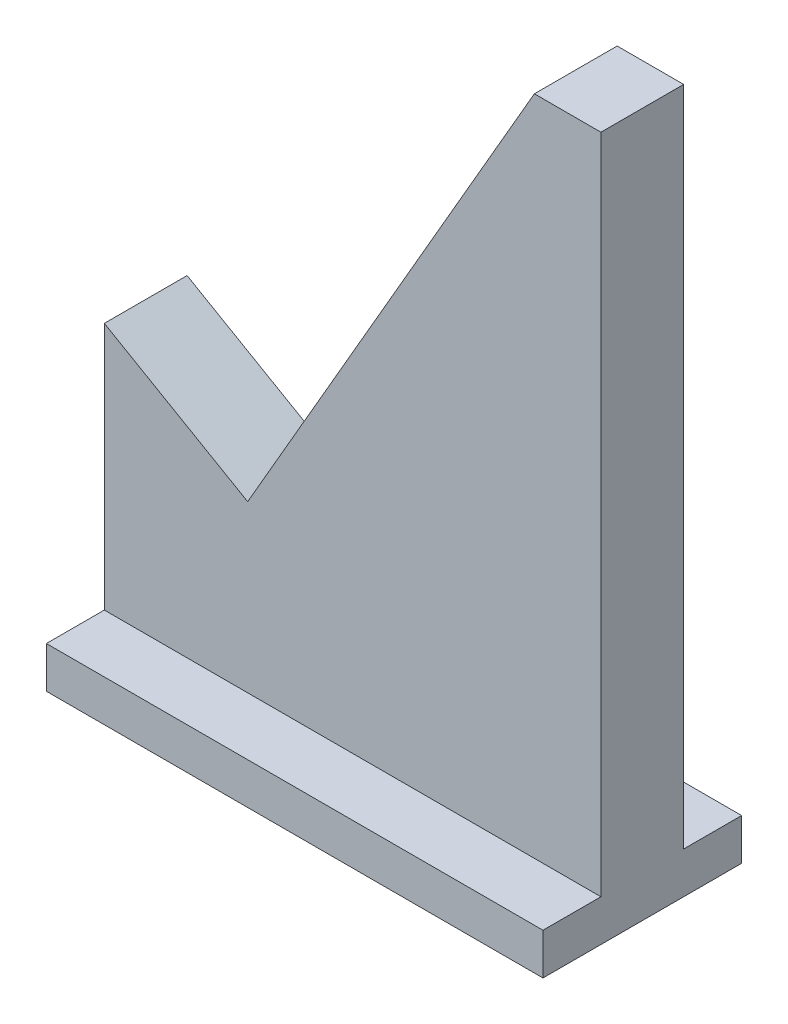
ISO-10303-21;
HEADER;
FILE_DESCRIPTION(('STEP AP214'),'2;1');
FILE_NAME('part.step','',(''),(''),'','','');
FILE_SCHEMA(('AUTOMOTIVE_DESIGN { 1 0 10303 214 1 1 1 1 }'));
ENDSEC;
DATA;
#1=APPLICATION_CONTEXT('core data for automotive mechanical design processes');
#2=APPLICATION_PROTOCOL_DEFINITION('international standard','automotive_design',2000,#1);
#3=PRODUCT_CONTEXT('',#1,'mechanical');
#4=PRODUCT('Part','Part','',(#3));
#5=PRODUCT_RELATED_PRODUCT_CATEGORY('part','',(#4));
#6=PRODUCT_DEFINITION_FORMATION('','',#4);
#7=PRODUCT_DEFINITION_CONTEXT('part definition',#1,'design');
#8=PRODUCT_DEFINITION('design','',#6,#7);
#9=PRODUCT_DEFINITION_SHAPE('','',#8);
#10=(LENGTH_UNIT() NAMED_UNIT(*) SI_UNIT(.MILLI.,.METRE.));
#11=(NAMED_UNIT(*) PLANE_ANGLE_UNIT() SI_UNIT($,.RADIAN.));
#12=(NAMED_UNIT(*) SI_UNIT($,.STERADIAN.) SOLID_ANGLE_UNIT());
#13=UNCERTAINTY_MEASURE_WITH_UNIT(LENGTH_MEASURE(1.E-05),#10,'distance_accuracy_value','');
#14=(GEOMETRIC_REPRESENTATION_CONTEXT(3) GLOBAL_UNCERTAINTY_ASSIGNED_CONTEXT((#13)) GLOBAL_UNIT_ASSIGNED_CONTEXT((#10,
#11,#12)) REPRESENTATION_CONTEXT('',''));
#15=CARTESIAN_POINT('',(0.,0.,0.));
#16=DIRECTION('',(0.,0.,1.));
#17=DIRECTION('',(1.,0.,0.));
#18=AXIS2_PLACEMENT_3D('',#15,#16,#17);
#19=CARTESIAN_POINT('',(-8.03847577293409,80.,5.));
#20=DIRECTION('',(0.866025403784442,-0.499999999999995,0.));
#21=DIRECTION('',(0.499999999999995,0.866025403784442,0.));
#22=AXIS2_PLACEMENT_3D('',#19,#20,#21);
#23=PLANE('',#22);
#24=DIRECTION('',(-0.499999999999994,-0.866025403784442,0.));
#25=VECTOR('',#24,1.);
#26=CARTESIAN_POINT('',(-8.03847577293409,80.,-5.));
#27=LINE('',#26,#25);
#28=CARTESIAN_POINT('',(-8.03847577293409,80.,-5.));
#29=VERTEX_POINT('',#28);
#30=CARTESIAN_POINT('',(-42.6794919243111,20.,-5.));
#31=VERTEX_POINT('',#30);
#32=EDGE_CURVE('E180',#29,#31,#27,.T.);
#33=ORIENTED_EDGE('',*,*,#32,.T.);
#34=DIRECTION('',(0.,0.,-1.));
#35=VECTOR('',#34,1.);
#36=CARTESIAN_POINT('',(-42.6794919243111,20.,5.));
#37=LINE('',#36,#35);
#38=CARTESIAN_POINT('',(-42.6794919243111,20.,5.));
#39=VERTEX_POINT('',#38);
#40=EDGE_CURVE('E11',#39,#31,#37,.T.);
#41=ORIENTED_EDGE('',*,*,#40,.F.);
#42=DIRECTION('',(-0.499999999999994,-0.866025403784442,0.));
#43=VECTOR('',#42,1.);
#44=CARTESIAN_POINT('',(-8.03847577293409,80.,5.));
#45=LINE('',#44,#43);
#46=CARTESIAN_POINT('',(-8.03847577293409,80.,5.));
#47=VERTEX_POINT('',#46);
#48=EDGE_CURVE('E139',#47,#39,#45,.T.);
#49=ORIENTED_EDGE('',*,*,#48,.F.);
#50=DIRECTION('',(0.,0.,-1.));
#51=VECTOR('',#50,1.);
#52=CARTESIAN_POINT('',(-8.03847577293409,80.,5.));
#53=LINE('',#52,#51);
#54=EDGE_CURVE('E116',#47,#29,#53,.T.);
#55=ORIENTED_EDGE('',*,*,#54,.T.);
#56=EDGE_LOOP('',(#33,#41,#49,#55));
#57=FACE_BOUND('',#56,.T.);
#58=ADVANCED_FACE('F33',(#57),#23,.F.);
#59=CARTESIAN_POINT('',(-42.6794919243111,20.,5.));
#60=DIRECTION('',(-0.499999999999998,-0.86602540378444,0.));
#61=DIRECTION('',(0.86602540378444,-0.499999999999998,0.));
#62=AXIS2_PLACEMENT_3D('',#59,#60,#61);
#63=PLANE('',#62);
#64=DIRECTION('',(-0.86602540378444,0.499999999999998,0.));
#65=VECTOR('',#64,1.);
#66=CARTESIAN_POINT('',(-42.6794919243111,20.,-5.));
#67=LINE('',#66,#65);
#68=CARTESIAN_POINT('',(-60.,30.,-5.));
#69=VERTEX_POINT('',#68);
#70=EDGE_CURVE('E129',#31,#69,#67,.T.);
#71=ORIENTED_EDGE('',*,*,#70,.T.);
#72=DIRECTION('',(0.,0.,-1.));
#73=VECTOR('',#72,1.);
#74=CARTESIAN_POINT('',(-60.,30.,5.));
#75=LINE('',#74,#73);
#76=CARTESIAN_POINT('',(-60.,30.,5.));
#77=VERTEX_POINT('',#76);
#78=EDGE_CURVE('E42',#77,#69,#75,.T.);
#79=ORIENTED_EDGE('',*,*,#78,.F.);
#80=DIRECTION('',(-0.86602540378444,0.499999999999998,0.));
#81=VECTOR('',#80,1.);
#82=CARTESIAN_POINT('',(-42.6794919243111,20.,5.));
#83=LINE('',#82,#81);
#84=EDGE_CURVE('E83',#39,#77,#83,.T.);
#85=ORIENTED_EDGE('',*,*,#84,.F.);
#86=ORIENTED_EDGE('',*,*,#40,.T.);
#87=EDGE_LOOP('',(#71,#79,#85,#86));
#88=FACE_BOUND('',#87,.T.);
#89=ADVANCED_FACE('F234',(#88),#63,.F.);
#90=CARTESIAN_POINT('',(-60.,0.,5.));
#91=DIRECTION('',(1.,0.,0.));
#92=DIRECTION('',(0.,0.,-1.));
#93=AXIS2_PLACEMENT_3D('',#90,#91,#92);
#94=PLANE('',#93);
#95=DIRECTION('',(0.,-1.,0.));
#96=VECTOR('',#95,1.);
#97=CARTESIAN_POINT('',(-60.,0.,-5.));
#98=LINE('',#97,#96);
#99=CARTESIAN_POINT('',(-60.,0.,-5.));
#100=VERTEX_POINT('',#99);
#101=EDGE_CURVE('E125',#69,#100,#98,.T.);
#102=ORIENTED_EDGE('',*,*,#101,.T.);
#103=DIRECTION('',(0.,0.,-1.));
#104=VECTOR('',#103,1.);
#105=CARTESIAN_POINT('',(-60.,0.,12.));
#106=LINE('',#105,#104);
#107=CARTESIAN_POINT('',(-60.,0.,-12.));
#108=VERTEX_POINT('',#107);
#109=EDGE_CURVE('E159',#100,#108,#106,.T.);
#110=ORIENTED_EDGE('',*,*,#109,.T.);
#111=DIRECTION('',(0.,-1.,0.));
#112=VECTOR('',#111,1.);
#113=CARTESIAN_POINT('',(-60.,0.,-12.));
#114=LINE('',#113,#112);
#115=CARTESIAN_POINT('',(-60.,-5.,-12.));
#116=VERTEX_POINT('',#115);
#117=EDGE_CURVE('E193',#108,#116,#114,.T.);
#118=ORIENTED_EDGE('',*,*,#117,.T.);
#119=DIRECTION('',(0.,0.,-1.));
#120=VECTOR('',#119,1.);
#121=CARTESIAN_POINT('',(-60.,-5.,12.));
#122=LINE('',#121,#120);
#123=CARTESIAN_POINT('',(-60.,-5.,12.));
#124=VERTEX_POINT('',#123);
#125=EDGE_CURVE('E178',#124,#116,#122,.T.);
#126=ORIENTED_EDGE('',*,*,#125,.F.);
#127=DIRECTION('',(0.,-1.,0.));
#128=VECTOR('',#127,1.);
#129=CARTESIAN_POINT('',(-60.,0.,12.));
#130=LINE('',#129,#128);
#131=CARTESIAN_POINT('',(-60.,0.,12.));
#132=VERTEX_POINT('',#131);
#133=EDGE_CURVE('E199',#132,#124,#130,.T.);
#134=ORIENTED_EDGE('',*,*,#133,.F.);
#135=CARTESIAN_POINT('',(-60.,0.,5.));
#136=VERTEX_POINT('',#135);
#137=EDGE_CURVE('E164',#132,#136,#106,.T.);
#138=ORIENTED_EDGE('',*,*,#137,.T.);
#139=DIRECTION('',(0.,-1.,0.));
#140=VECTOR('',#139,1.);
#141=CARTESIAN_POINT('',(-60.,0.,5.));
#142=LINE('',#141,#140);
#143=EDGE_CURVE('E111',#77,#136,#142,.T.);
#144=ORIENTED_EDGE('',*,*,#143,.F.);
#145=ORIENTED_EDGE('',*,*,#78,.T.);
#146=EDGE_LOOP('',(#102,#110,#118,#126,#134,#138,#144,#145));
#147=FACE_BOUND('',#146,.T.);
#148=ADVANCED_FACE('F145',(#147),#94,.F.);
#149=CARTESIAN_POINT('',(0.,80.,5.));
#150=DIRECTION('',(-1.,0.,0.));
#151=DIRECTION('',(0.,-1.,0.));
#152=AXIS2_PLACEMENT_3D('',#149,#150,#151);
#153=PLANE('',#152);
#154=DIRECTION('',(0.,1.,0.));
#155=VECTOR('',#154,1.);
#156=CARTESIAN_POINT('',(0.,80.,-5.));
#157=LINE('',#156,#155);
#158=CARTESIAN_POINT('',(0.,0.,-5.));
#159=VERTEX_POINT('',#158);
#160=CARTESIAN_POINT('',(0.,80.,-5.));
#161=VERTEX_POINT('',#160);
#162=EDGE_CURVE('E69',#159,#161,#157,.T.);
#163=ORIENTED_EDGE('',*,*,#162,.T.);
#164=DIRECTION('',(0.,0.,-1.));
#165=VECTOR('',#164,1.);
#166=CARTESIAN_POINT('',(0.,80.,5.));
#167=LINE('',#166,#165);
#168=CARTESIAN_POINT('',(0.,80.,5.));
#169=VERTEX_POINT('',#168);
#170=EDGE_CURVE('E114',#169,#161,#167,.T.);
#171=ORIENTED_EDGE('',*,*,#170,.F.);
#172=DIRECTION('',(0.,1.,0.));
#173=VECTOR('',#172,1.);
#174=CARTESIAN_POINT('',(0.,80.,5.));
#175=LINE('',#174,#173);
#176=CARTESIAN_POINT('',(0.,0.,5.));
#177=VERTEX_POINT('',#176);
#178=EDGE_CURVE('E109',#177,#169,#175,.T.);
#179=ORIENTED_EDGE('',*,*,#178,.F.);
#180=DIRECTION('',(0.,0.,-1.));
#181=VECTOR('',#180,1.);
#182=CARTESIAN_POINT('',(0.,0.,12.));
#183=LINE('',#182,#181);
#184=CARTESIAN_POINT('',(0.,0.,12.));
#185=VERTEX_POINT('',#184);
#186=EDGE_CURVE('E92',#185,#177,#183,.T.);
#187=ORIENTED_EDGE('',*,*,#186,.F.);
#188=DIRECTION('',(0.,1.,0.));
#189=VECTOR('',#188,1.);
#190=CARTESIAN_POINT('',(0.,0.,12.));
#191=LINE('',#190,#189);
#192=CARTESIAN_POINT('',(0.,-4.99999999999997,12.));
#193=VERTEX_POINT('',#192);
#194=EDGE_CURVE('E183',#193,#185,#191,.T.);
#195=ORIENTED_EDGE('',*,*,#194,.F.);
#196=DIRECTION('',(0.,0.,-1.));
#197=VECTOR('',#196,1.);
#198=CARTESIAN_POINT('',(0.,-4.99999999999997,12.));
#199=LINE('',#198,#197);
#200=CARTESIAN_POINT('',(0.,-4.99999999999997,-12.));
#201=VERTEX_POINT('',#200);
#202=EDGE_CURVE('E104',#193,#201,#199,.T.);
#203=ORIENTED_EDGE('',*,*,#202,.T.);
#204=DIRECTION('',(0.,1.,0.));
#205=VECTOR('',#204,1.);
#206=CARTESIAN_POINT('',(0.,0.,-12.));
#207=LINE('',#206,#205);
#208=CARTESIAN_POINT('',(0.,0.,-12.));
#209=VERTEX_POINT('',#208);
#210=EDGE_CURVE('E162',#201,#209,#207,.T.);
#211=ORIENTED_EDGE('',*,*,#210,.T.);
#212=EDGE_CURVE('E105',#159,#209,#183,.T.);
#213=ORIENTED_EDGE('',*,*,#212,.F.);
#214=EDGE_LOOP('',(#163,#171,#179,#187,#195,#203,#211,#213));
#215=FACE_BOUND('',#214,.T.);
#216=ADVANCED_FACE('F113',(#215),#153,.F.);
#217=CARTESIAN_POINT('',(-8.03847577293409,80.,5.));
#218=DIRECTION('',(0.,-1.,0.));
#219=DIRECTION('',(0.,0.,-1.));
#220=AXIS2_PLACEMENT_3D('',#217,#218,#219);
#221=PLANE('',#220);
#222=DIRECTION('',(-1.,0.,0.));
#223=VECTOR('',#222,1.);
#224=CARTESIAN_POINT('',(-8.03847577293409,80.,-5.));
#225=LINE('',#224,#223);
#226=EDGE_CURVE('E75',#161,#29,#225,.T.);
#227=ORIENTED_EDGE('',*,*,#226,.T.);
#228=ORIENTED_EDGE('',*,*,#54,.F.);
#229=DIRECTION('',(-1.,0.,0.));
#230=VECTOR('',#229,1.);
#231=CARTESIAN_POINT('',(-8.03847577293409,80.,5.));
#232=LINE('',#231,#230);
#233=EDGE_CURVE('E51',#169,#47,#232,.T.);
#234=ORIENTED_EDGE('',*,*,#233,.F.);
#235=ORIENTED_EDGE('',*,*,#170,.T.);
#236=EDGE_LOOP('',(#227,#228,#234,#235));
#237=FACE_BOUND('',#236,.T.);
#238=ADVANCED_FACE('F243',(#237),#221,.F.);
#239=CARTESIAN_POINT('',(-42.6794919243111,20.,5.));
#240=DIRECTION('',(0.,0.,-1.));
#241=DIRECTION('',(-1.,0.,0.));
#242=AXIS2_PLACEMENT_3D('',#239,#240,#241);
#243=PLANE('',#242);
#244=ORIENTED_EDGE('',*,*,#48,.T.);
#245=ORIENTED_EDGE('',*,*,#84,.T.);
#246=ORIENTED_EDGE('',*,*,#143,.T.);
#247=DIRECTION('',(1.,0.,0.));
#248=VECTOR('',#247,1.);
#249=CARTESIAN_POINT('',(-60.,0.,5.));
#250=LINE('',#249,#248);
#251=EDGE_CURVE('E97',#136,#177,#250,.T.);
#252=ORIENTED_EDGE('',*,*,#251,.T.);
#253=ORIENTED_EDGE('',*,*,#178,.T.);
#254=ORIENTED_EDGE('',*,*,#233,.T.);
#255=EDGE_LOOP('',(#244,#245,#246,#252,#253,#254));
#256=FACE_BOUND('',#255,.T.);
#257=ADVANCED_FACE('F108',(#256),#243,.F.);
#258=CARTESIAN_POINT('',(-42.6794919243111,20.,-5.));
#259=DIRECTION('',(0.,0.,-1.));
#260=DIRECTION('',(-1.,0.,0.));
#261=AXIS2_PLACEMENT_3D('',#258,#259,#260);
#262=PLANE('',#261);
#263=ORIENTED_EDGE('',*,*,#32,.F.);
#264=ORIENTED_EDGE('',*,*,#226,.F.);
#265=ORIENTED_EDGE('',*,*,#162,.F.);
#266=DIRECTION('',(1.,0.,0.));
#267=VECTOR('',#266,1.);
#268=CARTESIAN_POINT('',(-60.,0.,-5.));
#269=LINE('',#268,#267);
#270=EDGE_CURVE('E128',#100,#159,#269,.T.);
#271=ORIENTED_EDGE('',*,*,#270,.F.);
#272=ORIENTED_EDGE('',*,*,#101,.F.);
#273=ORIENTED_EDGE('',*,*,#70,.F.);
#274=EDGE_LOOP('',(#263,#264,#265,#271,#272,#273));
#275=FACE_BOUND('',#274,.T.);
#276=ADVANCED_FACE('F151',(#275),#262,.T.);
#277=CARTESIAN_POINT('',(-60.,0.,12.));
#278=DIRECTION('',(0.,-1.,0.));
#279=DIRECTION('',(1.,0.,0.));
#280=AXIS2_PLACEMENT_3D('',#277,#278,#279);
#281=PLANE('',#280);
#282=ORIENTED_EDGE('',*,*,#109,.F.);
#283=ORIENTED_EDGE('',*,*,#270,.T.);
#284=ORIENTED_EDGE('',*,*,#212,.T.);
#285=DIRECTION('',(-1.,0.,0.));
#286=VECTOR('',#285,1.);
#287=CARTESIAN_POINT('',(-60.,0.,-12.));
#288=LINE('',#287,#286);
#289=EDGE_CURVE('E198',#209,#108,#288,.T.);
#290=ORIENTED_EDGE('',*,*,#289,.T.);
#291=EDGE_LOOP('',(#282,#283,#284,#290));
#292=FACE_BOUND('',#291,.T.);
#293=ADVANCED_FACE('F155',(#292),#281,.F.);
#294=CARTESIAN_POINT('',(-60.,-5.,12.));
#295=DIRECTION('',(0.,1.,0.));
#296=DIRECTION('',(-1.,0.,0.));
#297=AXIS2_PLACEMENT_3D('',#294,#295,#296);
#298=PLANE('',#297);
#299=DIRECTION('',(1.,0.,0.));
#300=VECTOR('',#299,1.);
#301=CARTESIAN_POINT('',(-60.,-5.,-12.));
#302=LINE('',#301,#300);
#303=EDGE_CURVE('E195',#116,#201,#302,.T.);
#304=ORIENTED_EDGE('',*,*,#303,.T.);
#305=ORIENTED_EDGE('',*,*,#202,.F.);
#306=DIRECTION('',(1.,0.,0.));
#307=VECTOR('',#306,1.);
#308=CARTESIAN_POINT('',(-60.,-5.,12.));
#309=LINE('',#308,#307);
#310=EDGE_CURVE('E189',#124,#193,#309,.T.);
#311=ORIENTED_EDGE('',*,*,#310,.F.);
#312=ORIENTED_EDGE('',*,*,#125,.T.);
#313=EDGE_LOOP('',(#304,#305,#311,#312));
#314=FACE_BOUND('',#313,.T.);
#315=ADVANCED_FACE('F212',(#314),#298,.F.);
#316=ORIENTED_EDGE('',*,*,#251,.F.);
#317=ORIENTED_EDGE('',*,*,#137,.F.);
#318=DIRECTION('',(-1.,0.,0.));
#319=VECTOR('',#318,1.);
#320=CARTESIAN_POINT('',(-60.,0.,12.));
#321=LINE('',#320,#319);
#322=EDGE_CURVE('E101',#185,#132,#321,.T.);
#323=ORIENTED_EDGE('',*,*,#322,.F.);
#324=ORIENTED_EDGE('',*,*,#186,.T.);
#325=EDGE_LOOP('',(#316,#317,#323,#324));
#326=FACE_BOUND('',#325,.T.);
#327=ADVANCED_FACE('F94',(#326),#281,.F.);
#328=CARTESIAN_POINT('',(-60.,-5.,12.));
#329=DIRECTION('',(0.,0.,1.));
#330=DIRECTION('',(1.,0.,0.));
#331=AXIS2_PLACEMENT_3D('',#328,#329,#330);
#332=PLANE('',#331);
#333=ORIENTED_EDGE('',*,*,#133,.T.);
#334=ORIENTED_EDGE('',*,*,#310,.T.);
#335=ORIENTED_EDGE('',*,*,#194,.T.);
#336=ORIENTED_EDGE('',*,*,#322,.T.);
#337=EDGE_LOOP('',(#333,#334,#335,#336));
#338=FACE_BOUND('',#337,.T.);
#339=ADVANCED_FACE('F209',(#338),#332,.T.);
#340=CARTESIAN_POINT('',(-60.,-5.,-12.));
#341=DIRECTION('',(0.,0.,1.));
#342=DIRECTION('',(1.,0.,0.));
#343=AXIS2_PLACEMENT_3D('',#340,#341,#342);
#344=PLANE('',#343);
#345=ORIENTED_EDGE('',*,*,#117,.F.);
#346=ORIENTED_EDGE('',*,*,#289,.F.);
#347=ORIENTED_EDGE('',*,*,#210,.F.);
#348=ORIENTED_EDGE('',*,*,#303,.F.);
#349=EDGE_LOOP('',(#345,#346,#347,#348));
#350=FACE_BOUND('',#349,.T.);
#351=ADVANCED_FACE('F218',(#350),#344,.F.);
#352=CLOSED_SHELL('',(#58,#89,#148,#216,#238,#257,#276,#293,#315,#327,#339,#351));
#353=MANIFOLD_SOLID_BREP('B2',#352);
#354=ADVANCED_BREP_SHAPE_REPRESENTATION('',(#18,#353),#14);
#355=SHAPE_DEFINITION_REPRESENTATION(#9,#354);
ENDSEC;
END-ISO-10303-21;
